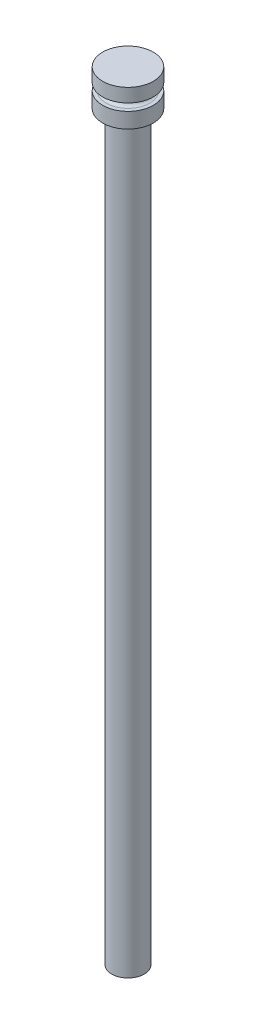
ISO-10303-21;
HEADER;
FILE_DESCRIPTION(('STEP AP214'),'2;1');
FILE_NAME('part.step','',(''),(''),'','','');
FILE_SCHEMA(('AUTOMOTIVE_DESIGN { 1 0 10303 214 1 1 1 1 }'));
ENDSEC;
DATA;
#1=APPLICATION_CONTEXT('core data for automotive mechanical design processes');
#2=APPLICATION_PROTOCOL_DEFINITION('international standard','automotive_design',2000,#1);
#3=PRODUCT_CONTEXT('',#1,'mechanical');
#4=PRODUCT('Part','Part','',(#3));
#5=PRODUCT_RELATED_PRODUCT_CATEGORY('part','',(#4));
#6=PRODUCT_DEFINITION_FORMATION('','',#4);
#7=PRODUCT_DEFINITION_CONTEXT('part definition',#1,'design');
#8=PRODUCT_DEFINITION('design','',#6,#7);
#9=PRODUCT_DEFINITION_SHAPE('','',#8);
#10=(LENGTH_UNIT() NAMED_UNIT(*) SI_UNIT(.MILLI.,.METRE.));
#11=(NAMED_UNIT(*) PLANE_ANGLE_UNIT() SI_UNIT($,.RADIAN.));
#12=(NAMED_UNIT(*) SI_UNIT($,.STERADIAN.) SOLID_ANGLE_UNIT());
#13=UNCERTAINTY_MEASURE_WITH_UNIT(LENGTH_MEASURE(1.E-05),#10,'distance_accuracy_value','');
#14=(GEOMETRIC_REPRESENTATION_CONTEXT(3) GLOBAL_UNCERTAINTY_ASSIGNED_CONTEXT((#13)) GLOBAL_UNIT_ASSIGNED_CONTEXT((#10,
#11,#12)) REPRESENTATION_CONTEXT('',''));
#15=CARTESIAN_POINT('',(0.,0.,0.));
#16=DIRECTION('',(0.,0.,1.));
#17=DIRECTION('',(1.,0.,0.));
#18=AXIS2_PLACEMENT_3D('',#15,#16,#17);
#19=CARTESIAN_POINT('',(14.,0.,0.));
#20=DIRECTION('',(0.,1.,0.));
#21=DIRECTION('',(0.,0.,1.));
#22=AXIS2_PLACEMENT_3D('',#19,#20,#21);
#23=CYLINDRICAL_SURFACE('',#22,14.);
#24=CARTESIAN_POINT('',(14.,-7.5,0.));
#25=DIRECTION('',(0.,1.,0.));
#26=DIRECTION('',(0.,0.,1.));
#27=AXIS2_PLACEMENT_3D('',#24,#25,#26);
#28=CIRCLE('',#27,14.);
#29=CARTESIAN_POINT('',(14.,-7.5,14.));
#30=VERTEX_POINT('',#29);
#31=EDGE_CURVE('E61',#30,#30,#28,.T.);
#32=ORIENTED_EDGE('',*,*,#31,.T.);
#33=EDGE_LOOP('',(#32));
#34=FACE_BOUND('',#33,.T.);
#35=CARTESIAN_POINT('',(14.,0.,0.));
#36=DIRECTION('',(0.,1.,0.));
#37=DIRECTION('',(0.,0.,1.));
#38=AXIS2_PLACEMENT_3D('',#35,#36,#37);
#39=CIRCLE('',#38,14.);
#40=CARTESIAN_POINT('',(14.,0.,14.));
#41=VERTEX_POINT('',#40);
#42=EDGE_CURVE('E10',#41,#41,#39,.T.);
#43=ORIENTED_EDGE('',*,*,#42,.F.);
#44=EDGE_LOOP('',(#43));
#45=FACE_BOUND('',#44,.T.);
#46=ADVANCED_FACE('F33',(#34,#45),#23,.T.);
#47=CARTESIAN_POINT('',(0.,0.,0.));
#48=DIRECTION('',(0.,1.,0.));
#49=DIRECTION('',(0.,0.,1.));
#50=AXIS2_PLACEMENT_3D('',#47,#48,#49);
#51=PLANE('',#50);
#52=ORIENTED_EDGE('',*,*,#42,.T.);
#53=EDGE_LOOP('',(#52));
#54=FACE_BOUND('',#53,.T.);
#55=ADVANCED_FACE('F79',(#54),#51,.T.);
#56=CARTESIAN_POINT('',(5.00000000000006,-430.,0.));
#57=DIRECTION('',(0.,-1.,0.));
#58=DIRECTION('',(0.,0.,-1.));
#59=AXIS2_PLACEMENT_3D('',#56,#57,#58);
#60=PLANE('',#59);
#61=CARTESIAN_POINT('',(14.,-430.,0.));
#62=DIRECTION('',(0.,1.,0.));
#63=DIRECTION('',(0.,0.,1.));
#64=AXIS2_PLACEMENT_3D('',#61,#62,#63);
#65=CIRCLE('',#64,8.99999999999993);
#66=CARTESIAN_POINT('',(14.,-430.,8.99999999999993));
#67=VERTEX_POINT('',#66);
#68=EDGE_CURVE('E39',#67,#67,#65,.T.);
#69=ORIENTED_EDGE('',*,*,#68,.F.);
#70=EDGE_LOOP('',(#69));
#71=FACE_BOUND('',#70,.T.);
#72=ADVANCED_FACE('F83',(#71),#60,.T.);
#73=CARTESIAN_POINT('',(14.,0.,0.));
#74=DIRECTION('',(0.,1.,0.));
#75=DIRECTION('',(0.,0.,1.));
#76=AXIS2_PLACEMENT_3D('',#73,#74,#75);
#77=CYLINDRICAL_SURFACE('',#76,8.99999999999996);
#78=ORIENTED_EDGE('',*,*,#68,.T.);
#79=EDGE_LOOP('',(#78));
#80=FACE_BOUND('',#79,.T.);
#81=CARTESIAN_POINT('',(14.,-20.,0.));
#82=DIRECTION('',(0.,1.,0.));
#83=DIRECTION('',(0.,0.,1.));
#84=AXIS2_PLACEMENT_3D('',#81,#82,#83);
#85=CIRCLE('',#84,8.99999999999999);
#86=CARTESIAN_POINT('',(14.,-20.,8.99999999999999));
#87=VERTEX_POINT('',#86);
#88=EDGE_CURVE('E43',#87,#87,#85,.T.);
#89=ORIENTED_EDGE('',*,*,#88,.F.);
#90=EDGE_LOOP('',(#89));
#91=FACE_BOUND('',#90,.T.);
#92=ADVANCED_FACE('F87',(#80,#91),#77,.T.);
#93=CARTESIAN_POINT('',(0.,-20.,0.));
#94=DIRECTION('',(0.,-1.,0.));
#95=DIRECTION('',(0.,0.,-1.));
#96=AXIS2_PLACEMENT_3D('',#93,#94,#95);
#97=PLANE('',#96);
#98=ORIENTED_EDGE('',*,*,#88,.T.);
#99=EDGE_LOOP('',(#98));
#100=FACE_BOUND('',#99,.T.);
#101=CARTESIAN_POINT('',(14.,-20.,0.));
#102=DIRECTION('',(0.,1.,0.));
#103=DIRECTION('',(0.,0.,1.));
#104=AXIS2_PLACEMENT_3D('',#101,#102,#103);
#105=CIRCLE('',#104,14.);
#106=CARTESIAN_POINT('',(14.,-20.,14.));
#107=VERTEX_POINT('',#106);
#108=EDGE_CURVE('E47',#107,#107,#105,.T.);
#109=ORIENTED_EDGE('',*,*,#108,.F.);
#110=EDGE_LOOP('',(#109));
#111=FACE_BOUND('',#110,.T.);
#112=ADVANCED_FACE('F93',(#100,#111),#97,.T.);
#113=CARTESIAN_POINT('',(14.,0.,0.));
#114=DIRECTION('',(0.,1.,0.));
#115=DIRECTION('',(0.,0.,1.));
#116=AXIS2_PLACEMENT_3D('',#113,#114,#115);
#117=CYLINDRICAL_SURFACE('',#116,14.);
#118=ORIENTED_EDGE('',*,*,#108,.T.);
#119=EDGE_LOOP('',(#118));
#120=FACE_BOUND('',#119,.T.);
#121=CARTESIAN_POINT('',(14.,-11.5,0.));
#122=DIRECTION('',(0.,1.,0.));
#123=DIRECTION('',(0.,0.,1.));
#124=AXIS2_PLACEMENT_3D('',#121,#122,#123);
#125=CIRCLE('',#124,14.);
#126=CARTESIAN_POINT('',(14.,-11.5,14.));
#127=VERTEX_POINT('',#126);
#128=EDGE_CURVE('E52',#127,#127,#125,.T.);
#129=ORIENTED_EDGE('',*,*,#128,.F.);
#130=EDGE_LOOP('',(#129));
#131=FACE_BOUND('',#130,.T.);
#132=ADVANCED_FACE('F96',(#120,#131),#117,.T.);
#133=CARTESIAN_POINT('',(2.,-11.5,0.));
#134=DIRECTION('',(0.,1.,0.));
#135=DIRECTION('',(0.,0.,1.));
#136=AXIS2_PLACEMENT_3D('',#133,#134,#135);
#137=PLANE('',#136);
#138=ORIENTED_EDGE('',*,*,#128,.T.);
#139=EDGE_LOOP('',(#138));
#140=FACE_BOUND('',#139,.T.);
#141=CARTESIAN_POINT('',(14.,-11.5,0.));
#142=DIRECTION('',(0.,1.,0.));
#143=DIRECTION('',(0.,0.,1.));
#144=AXIS2_PLACEMENT_3D('',#141,#142,#143);
#145=CIRCLE('',#144,12.);
#146=CARTESIAN_POINT('',(14.,-11.5,12.));
#147=VERTEX_POINT('',#146);
#148=EDGE_CURVE('E55',#147,#147,#145,.T.);
#149=ORIENTED_EDGE('',*,*,#148,.F.);
#150=EDGE_LOOP('',(#149));
#151=FACE_BOUND('',#150,.T.);
#152=ADVANCED_FACE('F75',(#140,#151),#137,.T.);
#153=CARTESIAN_POINT('',(14.,-9.5,0.));
#154=DIRECTION('',(0.,1.,0.));
#155=DIRECTION('',(0.,0.,1.));
#156=AXIS2_PLACEMENT_3D('',#153,#154,#155);
#157=TOROIDAL_SURFACE('',#156,12.,2.);
#158=ORIENTED_EDGE('',*,*,#148,.T.);
#159=EDGE_LOOP('',(#158));
#160=FACE_BOUND('',#159,.T.);
#161=CARTESIAN_POINT('',(14.,-7.5,0.));
#162=DIRECTION('',(0.,1.,0.));
#163=DIRECTION('',(0.,0.,1.));
#164=AXIS2_PLACEMENT_3D('',#161,#162,#163);
#165=CIRCLE('',#164,12.);
#166=CARTESIAN_POINT('',(14.,-7.5,12.));
#167=VERTEX_POINT('',#166);
#168=EDGE_CURVE('E58',#167,#167,#165,.T.);
#169=ORIENTED_EDGE('',*,*,#168,.F.);
#170=EDGE_LOOP('',(#169));
#171=FACE_BOUND('',#170,.T.);
#172=ADVANCED_FACE('F69',(#160,#171),#157,.F.);
#173=CARTESIAN_POINT('',(0.,-7.5,0.));
#174=DIRECTION('',(0.,-1.,0.));
#175=DIRECTION('',(0.,0.,-1.));
#176=AXIS2_PLACEMENT_3D('',#173,#174,#175);
#177=PLANE('',#176);
#178=ORIENTED_EDGE('',*,*,#168,.T.);
#179=EDGE_LOOP('',(#178));
#180=FACE_BOUND('',#179,.T.);
#181=ORIENTED_EDGE('',*,*,#31,.F.);
#182=EDGE_LOOP('',(#181));
#183=FACE_BOUND('',#182,.T.);
#184=ADVANCED_FACE('F67',(#180,#183),#177,.T.);
#185=CLOSED_SHELL('',(#46,#55,#72,#92,#112,#132,#152,#172,#184));
#186=MANIFOLD_SOLID_BREP('B2',#185);
#187=ADVANCED_BREP_SHAPE_REPRESENTATION('',(#18,#186),#14);
#188=SHAPE_DEFINITION_REPRESENTATION(#9,#187);
ENDSEC;
END-ISO-10303-21;
